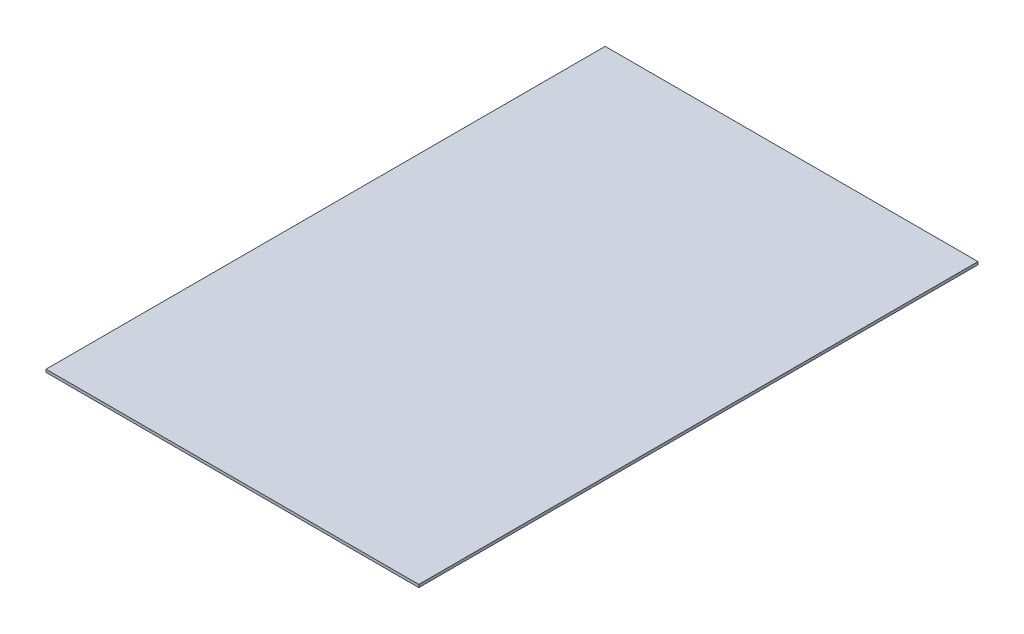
from build123d import *

# Parameters (mm, degrees)
ESQUISSE1_W      = 400
ESQUISSE1_H      = 600
EXTRUSION1_DEPTH = 3


with BuildPart() as part:
    # Esquisse1 → Extrusion1 (new body)
    with BuildSketch(Plane(origin=(0, 0, 0), x_dir=(1, 0, 0), z_dir=(0, 1, 0))):
        with Locations((200, 300)):
            Rectangle(ESQUISSE1_W, ESQUISSE1_H)
    extrude(amount=EXTRUSION1_DEPTH)


solid = part.part
